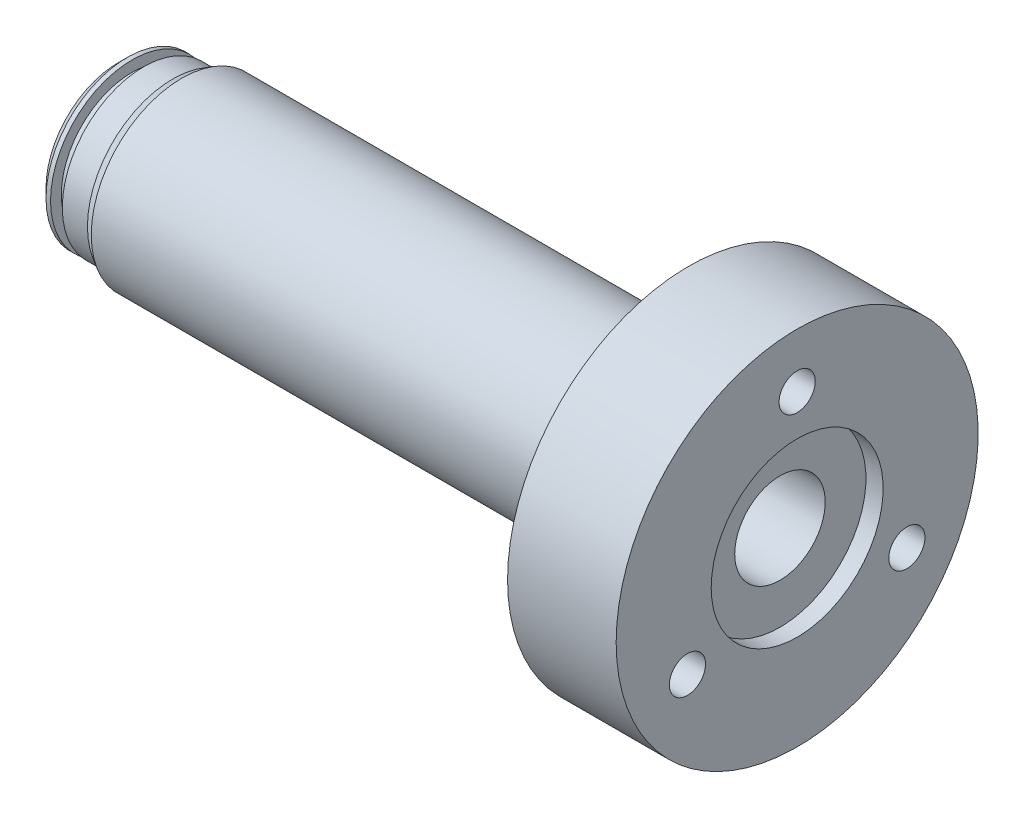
ISO-10303-21;
HEADER;
FILE_DESCRIPTION(('STEP AP214'),'2;1');
FILE_NAME('part.step','',(''),(''),'','','');
FILE_SCHEMA(('AUTOMOTIVE_DESIGN { 1 0 10303 214 1 1 1 1 }'));
ENDSEC;
DATA;
#1=APPLICATION_CONTEXT('core data for automotive mechanical design processes');
#2=APPLICATION_PROTOCOL_DEFINITION('international standard','automotive_design',2000,#1);
#3=PRODUCT_CONTEXT('',#1,'mechanical');
#4=PRODUCT('Part','Part','',(#3));
#5=PRODUCT_RELATED_PRODUCT_CATEGORY('part','',(#4));
#6=PRODUCT_DEFINITION_FORMATION('','',#4);
#7=PRODUCT_DEFINITION_CONTEXT('part definition',#1,'design');
#8=PRODUCT_DEFINITION('design','',#6,#7);
#9=PRODUCT_DEFINITION_SHAPE('','',#8);
#10=(LENGTH_UNIT() NAMED_UNIT(*) SI_UNIT(.MILLI.,.METRE.));
#11=(NAMED_UNIT(*) PLANE_ANGLE_UNIT() SI_UNIT($,.RADIAN.));
#12=(NAMED_UNIT(*) SI_UNIT($,.STERADIAN.) SOLID_ANGLE_UNIT());
#13=UNCERTAINTY_MEASURE_WITH_UNIT(LENGTH_MEASURE(1.E-05),#10,'distance_accuracy_value','');
#14=(GEOMETRIC_REPRESENTATION_CONTEXT(3) GLOBAL_UNCERTAINTY_ASSIGNED_CONTEXT((#13)) GLOBAL_UNIT_ASSIGNED_CONTEXT((#10,
#11,#12)) REPRESENTATION_CONTEXT('',''));
#15=CARTESIAN_POINT('',(0.,0.,0.));
#16=DIRECTION('',(0.,0.,1.));
#17=DIRECTION('',(1.,0.,0.));
#18=AXIS2_PLACEMENT_3D('',#15,#16,#17);
#19=CARTESIAN_POINT('',(75.,20.,0.));
#20=DIRECTION('',(-1.,0.,0.));
#21=DIRECTION('',(0.,0.,1.));
#22=AXIS2_PLACEMENT_3D('',#19,#20,#21);
#23=PLANE('',#22);
#24=CARTESIAN_POINT('',(75.,-6.99999999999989,-12.1243556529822));
#25=DIRECTION('',(1.,0.,0.));
#26=DIRECTION('',(0.,0.,-1.));
#27=AXIS2_PLACEMENT_3D('',#24,#25,#26);
#28=CIRCLE('',#27,2.);
#29=CARTESIAN_POINT('',(75.,-6.99999999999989,-14.1243556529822));
#30=VERTEX_POINT('',#29);
#31=EDGE_CURVE('E60',#30,#30,#28,.T.);
#32=ORIENTED_EDGE('',*,*,#31,.F.);
#33=EDGE_LOOP('',(#32));
#34=FACE_BOUND('',#33,.T.);
#35=CARTESIAN_POINT('',(75.,-7.00000000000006,12.1243556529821));
#36=DIRECTION('',(1.,0.,0.));
#37=DIRECTION('',(0.,0.,-1.));
#38=AXIS2_PLACEMENT_3D('',#35,#36,#37);
#39=CIRCLE('',#38,2.);
#40=CARTESIAN_POINT('',(75.,-7.00000000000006,10.1243556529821));
#41=VERTEX_POINT('',#40);
#42=EDGE_CURVE('E68',#41,#41,#39,.T.);
#43=ORIENTED_EDGE('',*,*,#42,.F.);
#44=EDGE_LOOP('',(#43));
#45=FACE_BOUND('',#44,.T.);
#46=CARTESIAN_POINT('',(75.,0.,0.));
#47=DIRECTION('',(-1.,0.,0.));
#48=DIRECTION('',(0.,0.,1.));
#49=AXIS2_PLACEMENT_3D('',#46,#47,#48);
#50=CIRCLE('',#49,9.5);
#51=CARTESIAN_POINT('',(75.,0.,9.5));
#52=VERTEX_POINT('',#51);
#53=EDGE_CURVE('E125',#52,#52,#50,.T.);
#54=ORIENTED_EDGE('',*,*,#53,.T.);
#55=EDGE_LOOP('',(#54));
#56=FACE_BOUND('',#55,.T.);
#57=CARTESIAN_POINT('',(75.,0.,0.));
#58=DIRECTION('',(-1.,0.,0.));
#59=DIRECTION('',(0.,0.,1.));
#60=AXIS2_PLACEMENT_3D('',#57,#58,#59);
#61=CIRCLE('',#60,20.);
#62=CARTESIAN_POINT('',(75.,0.,20.));
#63=VERTEX_POINT('',#62);
#64=EDGE_CURVE('E122',#63,#63,#61,.T.);
#65=ORIENTED_EDGE('',*,*,#64,.F.);
#66=EDGE_LOOP('',(#65));
#67=FACE_BOUND('',#66,.T.);
#68=CARTESIAN_POINT('',(75.,14.,0.));
#69=DIRECTION('',(1.,0.,0.));
#70=DIRECTION('',(0.,0.,-1.));
#71=AXIS2_PLACEMENT_3D('',#68,#69,#70);
#72=CIRCLE('',#71,2.);
#73=CARTESIAN_POINT('',(75.,14.,-2.));
#74=VERTEX_POINT('',#73);
#75=EDGE_CURVE('E74',#74,#74,#72,.T.);
#76=ORIENTED_EDGE('',*,*,#75,.F.);
#77=EDGE_LOOP('',(#76));
#78=FACE_BOUND('',#77,.T.);
#79=ADVANCED_FACE('F33',(#34,#45,#56,#67,#78),#23,.F.);
#80=CARTESIAN_POINT('',(0.,0.,0.));
#81=DIRECTION('',(-1.,0.,0.));
#82=DIRECTION('',(0.,0.,1.));
#83=AXIS2_PLACEMENT_3D('',#80,#81,#82);
#84=CYLINDRICAL_SURFACE('',#83,5.);
#85=CARTESIAN_POINT('',(73.1,0.,0.));
#86=DIRECTION('',(-1.,0.,0.));
#87=DIRECTION('',(0.,0.,1.));
#88=AXIS2_PLACEMENT_3D('',#85,#86,#87);
#89=CIRCLE('',#88,5.);
#90=CARTESIAN_POINT('',(73.1,0.,5.));
#91=VERTEX_POINT('',#90);
#92=EDGE_CURVE('E11',#91,#91,#89,.T.);
#93=ORIENTED_EDGE('',*,*,#92,.F.);
#94=EDGE_LOOP('',(#93));
#95=FACE_BOUND('',#94,.T.);
#96=CARTESIAN_POINT('',(0.,0.,0.));
#97=DIRECTION('',(-1.,0.,0.));
#98=DIRECTION('',(0.,0.,1.));
#99=AXIS2_PLACEMENT_3D('',#96,#97,#98);
#100=CIRCLE('',#99,4.99999999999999);
#101=CARTESIAN_POINT('',(0.,0.,4.99999999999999));
#102=VERTEX_POINT('',#101);
#103=EDGE_CURVE('E77',#102,#102,#100,.T.);
#104=ORIENTED_EDGE('',*,*,#103,.T.);
#105=EDGE_LOOP('',(#104));
#106=FACE_BOUND('',#105,.T.);
#107=ADVANCED_FACE('F35',(#95,#106),#84,.F.);
#108=CARTESIAN_POINT('',(73.1,9.5,0.));
#109=DIRECTION('',(-1.,0.,0.));
#110=DIRECTION('',(0.,0.,1.));
#111=AXIS2_PLACEMENT_3D('',#108,#109,#110);
#112=PLANE('',#111);
#113=CARTESIAN_POINT('',(73.1,0.,0.));
#114=DIRECTION('',(-1.,0.,0.));
#115=DIRECTION('',(0.,0.,1.));
#116=AXIS2_PLACEMENT_3D('',#113,#114,#115);
#117=CIRCLE('',#116,9.5);
#118=CARTESIAN_POINT('',(73.1,0.,9.5));
#119=VERTEX_POINT('',#118);
#120=EDGE_CURVE('E41',#119,#119,#117,.T.);
#121=ORIENTED_EDGE('',*,*,#120,.F.);
#122=EDGE_LOOP('',(#121));
#123=FACE_BOUND('',#122,.T.);
#124=ORIENTED_EDGE('',*,*,#92,.T.);
#125=EDGE_LOOP('',(#124));
#126=FACE_BOUND('',#125,.T.);
#127=ADVANCED_FACE('F132',(#123,#126),#112,.F.);
#128=CARTESIAN_POINT('',(0.,0.,0.));
#129=DIRECTION('',(-1.,0.,0.));
#130=DIRECTION('',(0.,0.,1.));
#131=AXIS2_PLACEMENT_3D('',#128,#129,#130);
#132=CYLINDRICAL_SURFACE('',#131,9.5);
#133=ORIENTED_EDGE('',*,*,#53,.F.);
#134=EDGE_LOOP('',(#133));
#135=FACE_BOUND('',#134,.T.);
#136=ORIENTED_EDGE('',*,*,#120,.T.);
#137=EDGE_LOOP('',(#136));
#138=FACE_BOUND('',#137,.T.);
#139=ADVANCED_FACE('F130',(#135,#138),#132,.F.);
#140=CARTESIAN_POINT('',(0.,0.,0.));
#141=DIRECTION('',(-1.,0.,0.));
#142=DIRECTION('',(0.,0.,1.));
#143=AXIS2_PLACEMENT_3D('',#140,#141,#142);
#144=CYLINDRICAL_SURFACE('',#143,20.);
#145=CARTESIAN_POINT('',(63.,0.,0.));
#146=DIRECTION('',(-1.,0.,0.));
#147=DIRECTION('',(0.,0.,1.));
#148=AXIS2_PLACEMENT_3D('',#145,#146,#147);
#149=CIRCLE('',#148,20.);
#150=CARTESIAN_POINT('',(63.,0.,20.));
#151=VERTEX_POINT('',#150);
#152=EDGE_CURVE('E119',#151,#151,#149,.T.);
#153=ORIENTED_EDGE('',*,*,#152,.F.);
#154=EDGE_LOOP('',(#153));
#155=FACE_BOUND('',#154,.T.);
#156=ORIENTED_EDGE('',*,*,#64,.T.);
#157=EDGE_LOOP('',(#156));
#158=FACE_BOUND('',#157,.T.);
#159=ADVANCED_FACE('F223',(#155,#158),#144,.T.);
#160=CARTESIAN_POINT('',(63.,12.5,0.));
#161=DIRECTION('',(1.,0.,0.));
#162=DIRECTION('',(0.,0.,-1.));
#163=AXIS2_PLACEMENT_3D('',#160,#161,#162);
#164=PLANE('',#163);
#165=CARTESIAN_POINT('',(63.,0.,0.));
#166=DIRECTION('',(-1.,0.,0.));
#167=DIRECTION('',(0.,0.,1.));
#168=AXIS2_PLACEMENT_3D('',#165,#166,#167);
#169=CIRCLE('',#168,12.5);
#170=CARTESIAN_POINT('',(63.,0.,12.5));
#171=VERTEX_POINT('',#170);
#172=EDGE_CURVE('E116',#171,#171,#169,.T.);
#173=ORIENTED_EDGE('',*,*,#172,.F.);
#174=EDGE_LOOP('',(#173));
#175=FACE_BOUND('',#174,.T.);
#176=ORIENTED_EDGE('',*,*,#152,.T.);
#177=EDGE_LOOP('',(#176));
#178=FACE_BOUND('',#177,.T.);
#179=ADVANCED_FACE('F217',(#175,#178),#164,.F.);
#180=CARTESIAN_POINT('',(0.,0.,0.));
#181=DIRECTION('',(-1.,0.,0.));
#182=DIRECTION('',(0.,0.,1.));
#183=AXIS2_PLACEMENT_3D('',#180,#181,#182);
#184=CYLINDRICAL_SURFACE('',#183,12.5);
#185=CARTESIAN_POINT('',(58.,0.,0.));
#186=DIRECTION('',(-1.,0.,0.));
#187=DIRECTION('',(0.,0.,1.));
#188=AXIS2_PLACEMENT_3D('',#185,#186,#187);
#189=CIRCLE('',#188,12.5);
#190=CARTESIAN_POINT('',(58.,0.,12.5));
#191=VERTEX_POINT('',#190);
#192=EDGE_CURVE('E113',#191,#191,#189,.T.);
#193=ORIENTED_EDGE('',*,*,#192,.F.);
#194=EDGE_LOOP('',(#193));
#195=FACE_BOUND('',#194,.T.);
#196=ORIENTED_EDGE('',*,*,#172,.T.);
#197=EDGE_LOOP('',(#196));
#198=FACE_BOUND('',#197,.T.);
#199=ADVANCED_FACE('F211',(#195,#198),#184,.T.);
#200=CARTESIAN_POINT('',(58.,10.,0.));
#201=DIRECTION('',(1.,0.,0.));
#202=DIRECTION('',(0.,0.,-1.));
#203=AXIS2_PLACEMENT_3D('',#200,#201,#202);
#204=PLANE('',#203);
#205=CARTESIAN_POINT('',(58.,0.,0.));
#206=DIRECTION('',(-1.,0.,0.));
#207=DIRECTION('',(0.,0.,1.));
#208=AXIS2_PLACEMENT_3D('',#205,#206,#207);
#209=CIRCLE('',#208,10.);
#210=CARTESIAN_POINT('',(58.,0.,10.));
#211=VERTEX_POINT('',#210);
#212=EDGE_CURVE('E110',#211,#211,#209,.T.);
#213=ORIENTED_EDGE('',*,*,#212,.F.);
#214=EDGE_LOOP('',(#213));
#215=FACE_BOUND('',#214,.T.);
#216=ORIENTED_EDGE('',*,*,#192,.T.);
#217=EDGE_LOOP('',(#216));
#218=FACE_BOUND('',#217,.T.);
#219=ADVANCED_FACE('F205',(#215,#218),#204,.F.);
#220=CARTESIAN_POINT('',(57.,0.,0.));
#221=DIRECTION('',(-1.,0.,0.));
#222=DIRECTION('',(0.,0.,1.));
#223=AXIS2_PLACEMENT_3D('',#220,#221,#222);
#224=TOROIDAL_SURFACE('',#223,10.,1.);
#225=CARTESIAN_POINT('',(56.,0.,0.));
#226=DIRECTION('',(-1.,0.,0.));
#227=DIRECTION('',(0.,0.,1.));
#228=AXIS2_PLACEMENT_3D('',#225,#226,#227);
#229=CIRCLE('',#228,10.);
#230=CARTESIAN_POINT('',(56.,0.,10.));
#231=VERTEX_POINT('',#230);
#232=EDGE_CURVE('E107',#231,#231,#229,.T.);
#233=ORIENTED_EDGE('',*,*,#232,.F.);
#234=EDGE_LOOP('',(#233));
#235=FACE_BOUND('',#234,.T.);
#236=ORIENTED_EDGE('',*,*,#212,.T.);
#237=EDGE_LOOP('',(#236));
#238=FACE_BOUND('',#237,.T.);
#239=ADVANCED_FACE('F199',(#235,#238),#224,.F.);
#240=CARTESIAN_POINT('',(0.,0.,0.));
#241=DIRECTION('',(-1.,0.,0.));
#242=DIRECTION('',(0.,0.,1.));
#243=AXIS2_PLACEMENT_3D('',#240,#241,#242);
#244=CYLINDRICAL_SURFACE('',#243,10.);
#245=CARTESIAN_POINT('',(7.,0.,0.));
#246=DIRECTION('',(-1.,0.,0.));
#247=DIRECTION('',(0.,0.,1.));
#248=AXIS2_PLACEMENT_3D('',#245,#246,#247);
#249=CIRCLE('',#248,10.);
#250=CARTESIAN_POINT('',(7.,0.,10.));
#251=VERTEX_POINT('',#250);
#252=EDGE_CURVE('E104',#251,#251,#249,.T.);
#253=ORIENTED_EDGE('',*,*,#252,.F.);
#254=EDGE_LOOP('',(#253));
#255=FACE_BOUND('',#254,.T.);
#256=ORIENTED_EDGE('',*,*,#232,.T.);
#257=EDGE_LOOP('',(#256));
#258=FACE_BOUND('',#257,.T.);
#259=ADVANCED_FACE('F193',(#255,#258),#244,.T.);
#260=CARTESIAN_POINT('',(7.,0.,0.));
#261=DIRECTION('',(1.,0.,0.));
#262=DIRECTION('',(0.,0.,-1.));
#263=AXIS2_PLACEMENT_3D('',#260,#261,#262);
#264=CONICAL_SURFACE('',#263,10.,0.523598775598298);
#265=CARTESIAN_POINT('',(6.,0.,0.));
#266=DIRECTION('',(-1.,0.,0.));
#267=DIRECTION('',(0.,0.,1.));
#268=AXIS2_PLACEMENT_3D('',#265,#266,#267);
#269=CIRCLE('',#268,9.42264973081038);
#270=CARTESIAN_POINT('',(6.,0.,9.42264973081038));
#271=VERTEX_POINT('',#270);
#272=EDGE_CURVE('E101',#271,#271,#269,.T.);
#273=ORIENTED_EDGE('',*,*,#272,.F.);
#274=EDGE_LOOP('',(#273));
#275=FACE_BOUND('',#274,.T.);
#276=ORIENTED_EDGE('',*,*,#252,.T.);
#277=EDGE_LOOP('',(#276));
#278=FACE_BOUND('',#277,.T.);
#279=ADVANCED_FACE('F187',(#275,#278),#264,.T.);
#280=CARTESIAN_POINT('',(6.,9.,0.));
#281=DIRECTION('',(1.,0.,0.));
#282=DIRECTION('',(0.,0.,-1.));
#283=AXIS2_PLACEMENT_3D('',#280,#281,#282);
#284=PLANE('',#283);
#285=CARTESIAN_POINT('',(6.,0.,0.));
#286=DIRECTION('',(-1.,0.,0.));
#287=DIRECTION('',(0.,0.,1.));
#288=AXIS2_PLACEMENT_3D('',#285,#286,#287);
#289=CIRCLE('',#288,9.);
#290=CARTESIAN_POINT('',(6.,0.,9.));
#291=VERTEX_POINT('',#290);
#292=EDGE_CURVE('E98',#291,#291,#289,.T.);
#293=ORIENTED_EDGE('',*,*,#292,.F.);
#294=EDGE_LOOP('',(#293));
#295=FACE_BOUND('',#294,.T.);
#296=ORIENTED_EDGE('',*,*,#272,.T.);
#297=EDGE_LOOP('',(#296));
#298=FACE_BOUND('',#297,.T.);
#299=ADVANCED_FACE('F181',(#295,#298),#284,.F.);
#300=CARTESIAN_POINT('',(0.,0.,0.));
#301=DIRECTION('',(-1.,0.,0.));
#302=DIRECTION('',(0.,0.,1.));
#303=AXIS2_PLACEMENT_3D('',#300,#301,#302);
#304=CYLINDRICAL_SURFACE('',#303,9.);
#305=CARTESIAN_POINT('',(2.8,0.,0.));
#306=DIRECTION('',(-1.,0.,0.));
#307=DIRECTION('',(0.,0.,1.));
#308=AXIS2_PLACEMENT_3D('',#305,#306,#307);
#309=CIRCLE('',#308,9.);
#310=CARTESIAN_POINT('',(2.8,0.,9.));
#311=VERTEX_POINT('',#310);
#312=EDGE_CURVE('E95',#311,#311,#309,.T.);
#313=ORIENTED_EDGE('',*,*,#312,.F.);
#314=EDGE_LOOP('',(#313));
#315=FACE_BOUND('',#314,.T.);
#316=ORIENTED_EDGE('',*,*,#292,.T.);
#317=EDGE_LOOP('',(#316));
#318=FACE_BOUND('',#317,.T.);
#319=ADVANCED_FACE('F175',(#315,#318),#304,.T.);
#320=CARTESIAN_POINT('',(2.8,9.,0.));
#321=DIRECTION('',(1.,0.,0.));
#322=DIRECTION('',(0.,0.,-1.));
#323=AXIS2_PLACEMENT_3D('',#320,#321,#322);
#324=PLANE('',#323);
#325=CARTESIAN_POINT('',(2.8,0.,0.));
#326=DIRECTION('',(-1.,0.,0.));
#327=DIRECTION('',(0.,0.,1.));
#328=AXIS2_PLACEMENT_3D('',#325,#326,#327);
#329=CIRCLE('',#328,7.80785278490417);
#330=CARTESIAN_POINT('',(2.8,0.,7.80785278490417));
#331=VERTEX_POINT('',#330);
#332=EDGE_CURVE('E92',#331,#331,#329,.T.);
#333=ORIENTED_EDGE('',*,*,#332,.F.);
#334=EDGE_LOOP('',(#333));
#335=FACE_BOUND('',#334,.T.);
#336=ORIENTED_EDGE('',*,*,#312,.T.);
#337=EDGE_LOOP('',(#336));
#338=FACE_BOUND('',#337,.T.);
#339=ADVANCED_FACE('F169',(#335,#338),#324,.F.);
#340=CARTESIAN_POINT('',(0.,0.,0.));
#341=DIRECTION('',(-1.,0.,0.));
#342=DIRECTION('',(0.,0.,1.));
#343=AXIS2_PLACEMENT_3D('',#340,#341,#342);
#344=CYLINDRICAL_SURFACE('',#343,7.80785278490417);
#345=CARTESIAN_POINT('',(1.5,0.,0.));
#346=DIRECTION('',(-1.,0.,0.));
#347=DIRECTION('',(0.,0.,1.));
#348=AXIS2_PLACEMENT_3D('',#345,#346,#347);
#349=CIRCLE('',#348,7.80785278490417);
#350=CARTESIAN_POINT('',(1.5,0.,7.80785278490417));
#351=VERTEX_POINT('',#350);
#352=EDGE_CURVE('E89',#351,#351,#349,.T.);
#353=ORIENTED_EDGE('',*,*,#352,.F.);
#354=EDGE_LOOP('',(#353));
#355=FACE_BOUND('',#354,.T.);
#356=ORIENTED_EDGE('',*,*,#332,.T.);
#357=EDGE_LOOP('',(#356));
#358=FACE_BOUND('',#357,.T.);
#359=ADVANCED_FACE('F163',(#355,#358),#344,.T.);
#360=CARTESIAN_POINT('',(1.5,9.,0.));
#361=DIRECTION('',(-1.,0.,0.));
#362=DIRECTION('',(0.,0.,1.));
#363=AXIS2_PLACEMENT_3D('',#360,#361,#362);
#364=PLANE('',#363);
#365=CARTESIAN_POINT('',(1.5,0.,0.));
#366=DIRECTION('',(-1.,0.,0.));
#367=DIRECTION('',(0.,0.,1.));
#368=AXIS2_PLACEMENT_3D('',#365,#366,#367);
#369=CIRCLE('',#368,9.);
#370=CARTESIAN_POINT('',(1.5,0.,9.));
#371=VERTEX_POINT('',#370);
#372=EDGE_CURVE('E86',#371,#371,#369,.T.);
#373=ORIENTED_EDGE('',*,*,#372,.F.);
#374=EDGE_LOOP('',(#373));
#375=FACE_BOUND('',#374,.T.);
#376=ORIENTED_EDGE('',*,*,#352,.T.);
#377=EDGE_LOOP('',(#376));
#378=FACE_BOUND('',#377,.T.);
#379=ADVANCED_FACE('F157',(#375,#378),#364,.F.);
#380=CARTESIAN_POINT('',(0.,0.,0.));
#381=DIRECTION('',(-1.,0.,0.));
#382=DIRECTION('',(0.,0.,1.));
#383=AXIS2_PLACEMENT_3D('',#380,#381,#382);
#384=CYLINDRICAL_SURFACE('',#383,9.);
#385=CARTESIAN_POINT('',(1.,0.,0.));
#386=DIRECTION('',(-1.,0.,0.));
#387=DIRECTION('',(0.,0.,1.));
#388=AXIS2_PLACEMENT_3D('',#385,#386,#387);
#389=CIRCLE('',#388,9.);
#390=CARTESIAN_POINT('',(1.,0.,9.));
#391=VERTEX_POINT('',#390);
#392=EDGE_CURVE('E83',#391,#391,#389,.T.);
#393=ORIENTED_EDGE('',*,*,#392,.F.);
#394=EDGE_LOOP('',(#393));
#395=FACE_BOUND('',#394,.T.);
#396=ORIENTED_EDGE('',*,*,#372,.T.);
#397=EDGE_LOOP('',(#396));
#398=FACE_BOUND('',#397,.T.);
#399=ADVANCED_FACE('F151',(#395,#398),#384,.T.);
#400=CARTESIAN_POINT('',(1.,0.,0.));
#401=DIRECTION('',(1.,0.,0.));
#402=DIRECTION('',(0.,0.,-1.));
#403=AXIS2_PLACEMENT_3D('',#400,#401,#402);
#404=CONICAL_SURFACE('',#403,9.,0.785398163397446);
#405=CARTESIAN_POINT('',(0.,0.,0.));
#406=DIRECTION('',(-1.,0.,0.));
#407=DIRECTION('',(0.,0.,1.));
#408=AXIS2_PLACEMENT_3D('',#405,#406,#407);
#409=CIRCLE('',#408,8.);
#410=CARTESIAN_POINT('',(0.,0.,8.));
#411=VERTEX_POINT('',#410);
#412=EDGE_CURVE('E80',#411,#411,#409,.T.);
#413=ORIENTED_EDGE('',*,*,#412,.F.);
#414=EDGE_LOOP('',(#413));
#415=FACE_BOUND('',#414,.T.);
#416=ORIENTED_EDGE('',*,*,#392,.T.);
#417=EDGE_LOOP('',(#416));
#418=FACE_BOUND('',#417,.T.);
#419=ADVANCED_FACE('F145',(#415,#418),#404,.T.);
#420=CARTESIAN_POINT('',(0.,4.99999999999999,0.));
#421=DIRECTION('',(1.,0.,0.));
#422=DIRECTION('',(0.,0.,-1.));
#423=AXIS2_PLACEMENT_3D('',#420,#421,#422);
#424=PLANE('',#423);
#425=ORIENTED_EDGE('',*,*,#103,.F.);
#426=EDGE_LOOP('',(#425));
#427=FACE_BOUND('',#426,.T.);
#428=ORIENTED_EDGE('',*,*,#412,.T.);
#429=EDGE_LOOP('',(#428));
#430=FACE_BOUND('',#429,.T.);
#431=ADVANCED_FACE('F141',(#427,#430),#424,.F.);
#432=CARTESIAN_POINT('',(75.,14.,0.));
#433=DIRECTION('',(1.,0.,0.));
#434=DIRECTION('',(0.,0.,-1.));
#435=AXIS2_PLACEMENT_3D('',#432,#433,#434);
#436=CYLINDRICAL_SURFACE('',#435,2.);
#437=CARTESIAN_POINT('',(66.,14.,0.));
#438=DIRECTION('',(1.,0.,0.));
#439=DIRECTION('',(0.,0.,-1.));
#440=AXIS2_PLACEMENT_3D('',#437,#438,#439);
#441=CIRCLE('',#440,2.);
#442=CARTESIAN_POINT('',(66.,14.,-2.));
#443=VERTEX_POINT('',#442);
#444=EDGE_CURVE('E71',#443,#443,#441,.T.);
#445=ORIENTED_EDGE('',*,*,#444,.F.);
#446=EDGE_LOOP('',(#445));
#447=FACE_BOUND('',#446,.T.);
#448=ORIENTED_EDGE('',*,*,#75,.T.);
#449=EDGE_LOOP('',(#448));
#450=FACE_BOUND('',#449,.T.);
#451=ADVANCED_FACE('F144',(#447,#450),#436,.F.);
#452=CARTESIAN_POINT('',(66.,14.,0.));
#453=DIRECTION('',(1.,0.,0.));
#454=DIRECTION('',(0.,0.,-1.));
#455=AXIS2_PLACEMENT_3D('',#452,#453,#454);
#456=CONICAL_SURFACE('',#455,2.,1.02974425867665);
#457=CARTESIAN_POINT('',(64.7982787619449,14.,0.));
#458=VERTEX_POINT('',#457);
#459=VERTEX_LOOP('',#458);
#460=FACE_BOUND('',#459,.T.);
#461=ORIENTED_EDGE('',*,*,#444,.T.);
#462=EDGE_LOOP('',(#461));
#463=FACE_BOUND('',#462,.T.);
#464=ADVANCED_FACE('F239',(#460,#463),#456,.F.);
#465=CARTESIAN_POINT('',(75.,-7.00000000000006,12.1243556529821));
#466=DIRECTION('',(1.,0.,0.));
#467=DIRECTION('',(0.,0.,-1.));
#468=AXIS2_PLACEMENT_3D('',#465,#466,#467);
#469=CYLINDRICAL_SURFACE('',#468,2.);
#470=CARTESIAN_POINT('',(66.,-7.00000000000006,12.1243556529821));
#471=DIRECTION('',(1.,0.,0.));
#472=DIRECTION('',(0.,0.,-1.));
#473=AXIS2_PLACEMENT_3D('',#470,#471,#472);
#474=CIRCLE('',#473,2.);
#475=CARTESIAN_POINT('',(66.,-7.00000000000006,10.1243556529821));
#476=VERTEX_POINT('',#475);
#477=EDGE_CURVE('E63',#476,#476,#474,.T.);
#478=ORIENTED_EDGE('',*,*,#477,.F.);
#479=EDGE_LOOP('',(#478));
#480=FACE_BOUND('',#479,.T.);
#481=ORIENTED_EDGE('',*,*,#42,.T.);
#482=EDGE_LOOP('',(#481));
#483=FACE_BOUND('',#482,.T.);
#484=ADVANCED_FACE('F245',(#480,#483),#469,.F.);
#485=CARTESIAN_POINT('',(66.,-7.00000000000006,12.1243556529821));
#486=DIRECTION('',(1.,0.,0.));
#487=DIRECTION('',(0.,0.,-1.));
#488=AXIS2_PLACEMENT_3D('',#485,#486,#487);
#489=CONICAL_SURFACE('',#488,2.,1.02974425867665);
#490=CARTESIAN_POINT('',(64.7982787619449,-7.00000000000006,12.1243556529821));
#491=VERTEX_POINT('',#490);
#492=VERTEX_LOOP('',#491);
#493=FACE_BOUND('',#492,.T.);
#494=ORIENTED_EDGE('',*,*,#477,.T.);
#495=EDGE_LOOP('',(#494));
#496=FACE_BOUND('',#495,.T.);
#497=ADVANCED_FACE('F346',(#493,#496),#489,.F.);
#498=CARTESIAN_POINT('',(75.,-6.99999999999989,-12.1243556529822));
#499=DIRECTION('',(1.,0.,0.));
#500=DIRECTION('',(0.,0.,-1.));
#501=AXIS2_PLACEMENT_3D('',#498,#499,#500);
#502=CYLINDRICAL_SURFACE('',#501,2.);
#503=CARTESIAN_POINT('',(66.,-6.99999999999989,-12.1243556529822));
#504=DIRECTION('',(1.,0.,0.));
#505=DIRECTION('',(0.,0.,-1.));
#506=AXIS2_PLACEMENT_3D('',#503,#504,#505);
#507=CIRCLE('',#506,2.);
#508=CARTESIAN_POINT('',(66.,-6.99999999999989,-14.1243556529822));
#509=VERTEX_POINT('',#508);
#510=EDGE_CURVE('E58',#509,#509,#507,.T.);
#511=ORIENTED_EDGE('',*,*,#510,.F.);
#512=EDGE_LOOP('',(#511));
#513=FACE_BOUND('',#512,.T.);
#514=ORIENTED_EDGE('',*,*,#31,.T.);
#515=EDGE_LOOP('',(#514));
#516=FACE_BOUND('',#515,.T.);
#517=ADVANCED_FACE('F54',(#513,#516),#502,.F.);
#518=CARTESIAN_POINT('',(66.,-6.99999999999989,-12.1243556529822));
#519=DIRECTION('',(1.,0.,0.));
#520=DIRECTION('',(0.,0.,-1.));
#521=AXIS2_PLACEMENT_3D('',#518,#519,#520);
#522=CONICAL_SURFACE('',#521,2.,1.02974425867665);
#523=CARTESIAN_POINT('',(64.7982787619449,-6.99999999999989,-12.1243556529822));
#524=VERTEX_POINT('',#523);
#525=VERTEX_LOOP('',#524);
#526=FACE_BOUND('',#525,.T.);
#527=ORIENTED_EDGE('',*,*,#510,.T.);
#528=EDGE_LOOP('',(#527));
#529=FACE_BOUND('',#528,.T.);
#530=ADVANCED_FACE('F51',(#526,#529),#522,.F.);
#531=CLOSED_SHELL('',(#79,#107,#127,#139,#159,#179,#199,#219,#239,#259,#279,#299,#319,#339,#359,
#379,#399,#419,#431,#451,#464,#484,#497,#517,#530));
#532=MANIFOLD_SOLID_BREP('B2',#531);
#533=ADVANCED_BREP_SHAPE_REPRESENTATION('',(#18,#532),#14);
#534=SHAPE_DEFINITION_REPRESENTATION(#9,#533);
ENDSEC;
END-ISO-10303-21;
